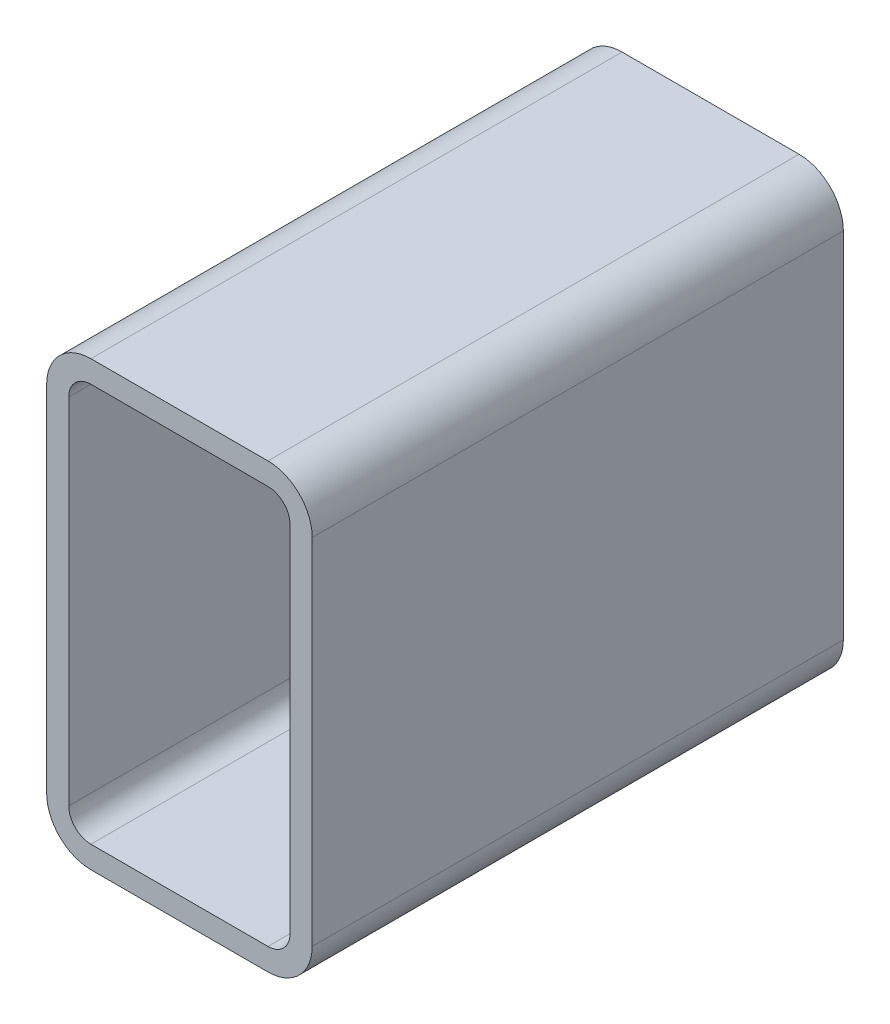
ISO-10303-21;
HEADER;
FILE_DESCRIPTION(('STEP AP214'),'2;1');
FILE_NAME('part.step','',(''),(''),'','','');
FILE_SCHEMA(('AUTOMOTIVE_DESIGN { 1 0 10303 214 1 1 1 1 }'));
ENDSEC;
DATA;
#1=APPLICATION_CONTEXT('core data for automotive mechanical design processes');
#2=APPLICATION_PROTOCOL_DEFINITION('international standard','automotive_design',2000,#1);
#3=PRODUCT_CONTEXT('',#1,'mechanical');
#4=PRODUCT('Part','Part','',(#3));
#5=PRODUCT_RELATED_PRODUCT_CATEGORY('part','',(#4));
#6=PRODUCT_DEFINITION_FORMATION('','',#4);
#7=PRODUCT_DEFINITION_CONTEXT('part definition',#1,'design');
#8=PRODUCT_DEFINITION('design','',#6,#7);
#9=PRODUCT_DEFINITION_SHAPE('','',#8);
#10=(LENGTH_UNIT() NAMED_UNIT(*) SI_UNIT(.MILLI.,.METRE.));
#11=(NAMED_UNIT(*) PLANE_ANGLE_UNIT() SI_UNIT($,.RADIAN.));
#12=(NAMED_UNIT(*) SI_UNIT($,.STERADIAN.) SOLID_ANGLE_UNIT());
#13=UNCERTAINTY_MEASURE_WITH_UNIT(LENGTH_MEASURE(1.E-05),#10,'distance_accuracy_value','');
#14=(GEOMETRIC_REPRESENTATION_CONTEXT(3) GLOBAL_UNCERTAINTY_ASSIGNED_CONTEXT((#13)) GLOBAL_UNIT_ASSIGNED_CONTEXT((#10,
#11,#12)) REPRESENTATION_CONTEXT('',''));
#15=CARTESIAN_POINT('',(0.,0.,0.));
#16=DIRECTION('',(0.,0.,1.));
#17=DIRECTION('',(1.,0.,0.));
#18=AXIS2_PLACEMENT_3D('',#15,#16,#17);
#19=CARTESIAN_POINT('',(25.4473013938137,230.520313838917,304.8));
#20=DIRECTION('',(0.,0.,1.));
#21=DIRECTION('',(1.,0.,0.));
#22=AXIS2_PLACEMENT_3D('',#19,#20,#21);
#23=PLANE('',#22);
#24=CARTESIAN_POINT('',(25.4473013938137,230.520313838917,304.8));
#25=DIRECTION('',(0.,0.,1.));
#26=DIRECTION('',(1.,0.,0.));
#27=AXIS2_PLACEMENT_3D('',#24,#25,#26);
#28=CIRCLE('',#27,25.4);
#29=CARTESIAN_POINT('',(25.4473013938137,255.920313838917,304.8));
#30=VERTEX_POINT('',#29);
#31=CARTESIAN_POINT('',(0.0473013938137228,230.520313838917,304.8));
#32=VERTEX_POINT('',#31);
#33=EDGE_CURVE('E211',#30,#32,#28,.T.);
#34=ORIENTED_EDGE('',*,*,#33,.T.);
#35=DIRECTION('',(0.,-1.,0.));
#36=VECTOR('',#35,1.);
#37=CARTESIAN_POINT('',(0.0473013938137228,27.3203138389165,304.8));
#38=LINE('',#37,#36);
#39=CARTESIAN_POINT('',(0.0473013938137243,27.3203138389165,304.8));
#40=VERTEX_POINT('',#39);
#41=EDGE_CURVE('E214',#32,#40,#38,.T.);
#42=ORIENTED_EDGE('',*,*,#41,.T.);
#43=CARTESIAN_POINT('',(25.4473013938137,27.3203138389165,304.8));
#44=DIRECTION('',(0.,0.,1.));
#45=DIRECTION('',(1.,0.,0.));
#46=AXIS2_PLACEMENT_3D('',#43,#44,#45);
#47=CIRCLE('',#46,25.4);
#48=CARTESIAN_POINT('',(25.4473013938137,1.92031383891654,304.8));
#49=VERTEX_POINT('',#48);
#50=EDGE_CURVE('E217',#40,#49,#47,.T.);
#51=ORIENTED_EDGE('',*,*,#50,.T.);
#52=DIRECTION('',(1.,0.,0.));
#53=VECTOR('',#52,1.);
#54=CARTESIAN_POINT('',(127.047301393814,1.92031383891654,304.8));
#55=LINE('',#54,#53);
#56=CARTESIAN_POINT('',(127.047301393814,1.92031383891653,304.8));
#57=VERTEX_POINT('',#56);
#58=EDGE_CURVE('E219',#49,#57,#55,.T.);
#59=ORIENTED_EDGE('',*,*,#58,.T.);
#60=CARTESIAN_POINT('',(127.047301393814,27.3203138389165,304.8));
#61=DIRECTION('',(0.,0.,1.));
#62=DIRECTION('',(1.,0.,0.));
#63=AXIS2_PLACEMENT_3D('',#60,#61,#62);
#64=CIRCLE('',#63,25.4);
#65=CARTESIAN_POINT('',(152.447301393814,27.3203138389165,304.8));
#66=VERTEX_POINT('',#65);
#67=EDGE_CURVE('E221',#57,#66,#64,.T.);
#68=ORIENTED_EDGE('',*,*,#67,.T.);
#69=DIRECTION('',(0.,1.,0.));
#70=VECTOR('',#69,1.);
#71=CARTESIAN_POINT('',(152.447301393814,230.520313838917,304.8));
#72=LINE('',#71,#70);
#73=CARTESIAN_POINT('',(152.447301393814,230.520313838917,304.8));
#74=VERTEX_POINT('',#73);
#75=EDGE_CURVE('E223',#66,#74,#72,.T.);
#76=ORIENTED_EDGE('',*,*,#75,.T.);
#77=CARTESIAN_POINT('',(127.047301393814,230.520313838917,304.8));
#78=DIRECTION('',(0.,0.,1.));
#79=DIRECTION('',(1.,0.,0.));
#80=AXIS2_PLACEMENT_3D('',#77,#78,#79);
#81=CIRCLE('',#80,25.4);
#82=CARTESIAN_POINT('',(127.047301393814,255.920313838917,304.8));
#83=VERTEX_POINT('',#82);
#84=EDGE_CURVE('E225',#74,#83,#81,.T.);
#85=ORIENTED_EDGE('',*,*,#84,.T.);
#86=DIRECTION('',(-1.,0.,0.));
#87=VECTOR('',#86,1.);
#88=CARTESIAN_POINT('',(25.4473013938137,255.920313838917,304.8));
#89=LINE('',#88,#87);
#90=EDGE_CURVE('E227',#83,#30,#89,.T.);
#91=ORIENTED_EDGE('',*,*,#90,.T.);
#92=EDGE_LOOP('',(#34,#42,#51,#59,#68,#76,#85,#91));
#93=FACE_BOUND('',#92,.T.);
#94=DIRECTION('',(0.,-1.,0.));
#95=VECTOR('',#94,1.);
#96=CARTESIAN_POINT('',(12.7473013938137,27.3203138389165,304.8));
#97=LINE('',#96,#95);
#98=CARTESIAN_POINT('',(12.7473013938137,230.520313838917,304.8));
#99=VERTEX_POINT('',#98);
#100=CARTESIAN_POINT('',(12.7473013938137,27.3203138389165,304.8));
#101=VERTEX_POINT('',#100);
#102=EDGE_CURVE('E154',#99,#101,#97,.T.);
#103=ORIENTED_EDGE('',*,*,#102,.F.);
#104=CARTESIAN_POINT('',(25.4473013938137,230.520313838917,304.8));
#105=DIRECTION('',(0.,0.,1.));
#106=DIRECTION('',(1.,0.,0.));
#107=AXIS2_PLACEMENT_3D('',#104,#105,#106);
#108=CIRCLE('',#107,12.7);
#109=CARTESIAN_POINT('',(25.4473013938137,243.220313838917,304.8));
#110=VERTEX_POINT('',#109);
#111=EDGE_CURVE('E146',#110,#99,#108,.T.);
#112=ORIENTED_EDGE('',*,*,#111,.F.);
#113=DIRECTION('',(-1.,0.,0.));
#114=VECTOR('',#113,1.);
#115=CARTESIAN_POINT('',(25.4473013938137,243.220313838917,304.8));
#116=LINE('',#115,#114);
#117=CARTESIAN_POINT('',(127.047301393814,243.220313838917,304.8));
#118=VERTEX_POINT('',#117);
#119=EDGE_CURVE('E179',#118,#110,#116,.T.);
#120=ORIENTED_EDGE('',*,*,#119,.F.);
#121=CARTESIAN_POINT('',(127.047301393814,230.520313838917,304.8));
#122=DIRECTION('',(0.,0.,1.));
#123=DIRECTION('',(1.,0.,0.));
#124=AXIS2_PLACEMENT_3D('',#121,#122,#123);
#125=CIRCLE('',#124,12.7);
#126=CARTESIAN_POINT('',(139.747301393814,230.520313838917,304.8));
#127=VERTEX_POINT('',#126);
#128=EDGE_CURVE('E177',#127,#118,#125,.T.);
#129=ORIENTED_EDGE('',*,*,#128,.F.);
#130=DIRECTION('',(0.,1.,0.));
#131=VECTOR('',#130,1.);
#132=CARTESIAN_POINT('',(139.747301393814,230.520313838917,304.8));
#133=LINE('',#132,#131);
#134=CARTESIAN_POINT('',(139.747301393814,27.3203138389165,304.8));
#135=VERTEX_POINT('',#134);
#136=EDGE_CURVE('E175',#135,#127,#133,.T.);
#137=ORIENTED_EDGE('',*,*,#136,.F.);
#138=CARTESIAN_POINT('',(127.047301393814,27.3203138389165,304.8));
#139=DIRECTION('',(0.,0.,1.));
#140=DIRECTION('',(1.,0.,0.));
#141=AXIS2_PLACEMENT_3D('',#138,#139,#140);
#142=CIRCLE('',#141,12.7);
#143=CARTESIAN_POINT('',(127.047301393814,14.6203138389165,304.8));
#144=VERTEX_POINT('',#143);
#145=EDGE_CURVE('E173',#144,#135,#142,.T.);
#146=ORIENTED_EDGE('',*,*,#145,.F.);
#147=DIRECTION('',(1.,0.,0.));
#148=VECTOR('',#147,1.);
#149=CARTESIAN_POINT('',(127.047301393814,14.6203138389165,304.8));
#150=LINE('',#149,#148);
#151=CARTESIAN_POINT('',(25.4473013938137,14.6203138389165,304.8));
#152=VERTEX_POINT('',#151);
#153=EDGE_CURVE('E169',#152,#144,#150,.T.);
#154=ORIENTED_EDGE('',*,*,#153,.F.);
#155=CARTESIAN_POINT('',(25.4473013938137,27.3203138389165,304.8));
#156=DIRECTION('',(0.,0.,1.));
#157=DIRECTION('',(1.,0.,0.));
#158=AXIS2_PLACEMENT_3D('',#155,#156,#157);
#159=CIRCLE('',#158,12.7);
#160=EDGE_CURVE('E167',#101,#152,#159,.T.);
#161=ORIENTED_EDGE('',*,*,#160,.F.);
#162=EDGE_LOOP('',(#103,#112,#120,#129,#137,#146,#154,#161));
#163=FACE_BOUND('',#162,.T.);
#164=ADVANCED_FACE('F33',(#93,#163),#23,.T.);
#165=CARTESIAN_POINT('',(25.4473013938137,230.520313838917,0.));
#166=DIRECTION('',(0.,0.,1.));
#167=DIRECTION('',(1.,0.,0.));
#168=AXIS2_PLACEMENT_3D('',#165,#166,#167);
#169=PLANE('',#168);
#170=CARTESIAN_POINT('',(25.4473013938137,230.520313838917,0.));
#171=DIRECTION('',(0.,0.,1.));
#172=DIRECTION('',(1.,0.,0.));
#173=AXIS2_PLACEMENT_3D('',#170,#171,#172);
#174=CIRCLE('',#173,25.4);
#175=CARTESIAN_POINT('',(25.4473013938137,255.920313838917,0.));
#176=VERTEX_POINT('',#175);
#177=CARTESIAN_POINT('',(0.0473013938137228,230.520313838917,0.));
#178=VERTEX_POINT('',#177);
#179=EDGE_CURVE('E162',#176,#178,#174,.T.);
#180=ORIENTED_EDGE('',*,*,#179,.F.);
#181=DIRECTION('',(-1.,0.,0.));
#182=VECTOR('',#181,1.);
#183=CARTESIAN_POINT('',(25.4473013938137,255.920313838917,0.));
#184=LINE('',#183,#182);
#185=CARTESIAN_POINT('',(127.047301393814,255.920313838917,0.));
#186=VERTEX_POINT('',#185);
#187=EDGE_CURVE('E215',#186,#176,#184,.T.);
#188=ORIENTED_EDGE('',*,*,#187,.F.);
#189=CARTESIAN_POINT('',(127.047301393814,230.520313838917,0.));
#190=DIRECTION('',(0.,0.,1.));
#191=DIRECTION('',(1.,0.,0.));
#192=AXIS2_PLACEMENT_3D('',#189,#190,#191);
#193=CIRCLE('',#192,25.4);
#194=CARTESIAN_POINT('',(152.447301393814,230.520313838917,0.));
#195=VERTEX_POINT('',#194);
#196=EDGE_CURVE('E242',#195,#186,#193,.T.);
#197=ORIENTED_EDGE('',*,*,#196,.F.);
#198=DIRECTION('',(0.,1.,0.));
#199=VECTOR('',#198,1.);
#200=CARTESIAN_POINT('',(152.447301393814,230.520313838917,0.));
#201=LINE('',#200,#199);
#202=CARTESIAN_POINT('',(152.447301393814,27.3203138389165,0.));
#203=VERTEX_POINT('',#202);
#204=EDGE_CURVE('E240',#203,#195,#201,.T.);
#205=ORIENTED_EDGE('',*,*,#204,.F.);
#206=CARTESIAN_POINT('',(127.047301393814,27.3203138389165,0.));
#207=DIRECTION('',(0.,0.,1.));
#208=DIRECTION('',(1.,0.,0.));
#209=AXIS2_PLACEMENT_3D('',#206,#207,#208);
#210=CIRCLE('',#209,25.4);
#211=CARTESIAN_POINT('',(127.047301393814,1.92031383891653,0.));
#212=VERTEX_POINT('',#211);
#213=EDGE_CURVE('E238',#212,#203,#210,.T.);
#214=ORIENTED_EDGE('',*,*,#213,.F.);
#215=DIRECTION('',(1.,0.,0.));
#216=VECTOR('',#215,1.);
#217=CARTESIAN_POINT('',(127.047301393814,1.92031383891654,0.));
#218=LINE('',#217,#216);
#219=CARTESIAN_POINT('',(25.4473013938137,1.92031383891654,0.));
#220=VERTEX_POINT('',#219);
#221=EDGE_CURVE('E236',#220,#212,#218,.T.);
#222=ORIENTED_EDGE('',*,*,#221,.F.);
#223=CARTESIAN_POINT('',(25.4473013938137,27.3203138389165,0.));
#224=DIRECTION('',(0.,0.,1.));
#225=DIRECTION('',(1.,0.,0.));
#226=AXIS2_PLACEMENT_3D('',#223,#224,#225);
#227=CIRCLE('',#226,25.4);
#228=CARTESIAN_POINT('',(0.0473013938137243,27.3203138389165,0.));
#229=VERTEX_POINT('',#228);
#230=EDGE_CURVE('E234',#229,#220,#227,.T.);
#231=ORIENTED_EDGE('',*,*,#230,.F.);
#232=DIRECTION('',(0.,-1.,0.));
#233=VECTOR('',#232,1.);
#234=CARTESIAN_POINT('',(0.0473013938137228,27.3203138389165,0.));
#235=LINE('',#234,#233);
#236=EDGE_CURVE('E232',#178,#229,#235,.T.);
#237=ORIENTED_EDGE('',*,*,#236,.F.);
#238=EDGE_LOOP('',(#180,#188,#197,#205,#214,#222,#231,#237));
#239=FACE_BOUND('',#238,.T.);
#240=CARTESIAN_POINT('',(25.4473013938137,230.520313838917,0.));
#241=DIRECTION('',(0.,0.,1.));
#242=DIRECTION('',(1.,0.,0.));
#243=AXIS2_PLACEMENT_3D('',#240,#241,#242);
#244=CIRCLE('',#243,12.7);
#245=CARTESIAN_POINT('',(25.4473013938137,243.220313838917,0.));
#246=VERTEX_POINT('',#245);
#247=CARTESIAN_POINT('',(12.7473013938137,230.520313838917,0.));
#248=VERTEX_POINT('',#247);
#249=EDGE_CURVE('E56',#246,#248,#244,.T.);
#250=ORIENTED_EDGE('',*,*,#249,.T.);
#251=DIRECTION('',(0.,-1.,0.));
#252=VECTOR('',#251,1.);
#253=CARTESIAN_POINT('',(12.7473013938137,27.3203138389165,0.));
#254=LINE('',#253,#252);
#255=CARTESIAN_POINT('',(12.7473013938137,27.3203138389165,0.));
#256=VERTEX_POINT('',#255);
#257=EDGE_CURVE('E161',#248,#256,#254,.T.);
#258=ORIENTED_EDGE('',*,*,#257,.T.);
#259=CARTESIAN_POINT('',(25.4473013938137,27.3203138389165,0.));
#260=DIRECTION('',(0.,0.,1.));
#261=DIRECTION('',(1.,0.,0.));
#262=AXIS2_PLACEMENT_3D('',#259,#260,#261);
#263=CIRCLE('',#262,12.7);
#264=CARTESIAN_POINT('',(25.4473013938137,14.6203138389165,0.));
#265=VERTEX_POINT('',#264);
#266=EDGE_CURVE('E183',#256,#265,#263,.T.);
#267=ORIENTED_EDGE('',*,*,#266,.T.);
#268=DIRECTION('',(1.,0.,0.));
#269=VECTOR('',#268,1.);
#270=CARTESIAN_POINT('',(127.047301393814,14.6203138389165,0.));
#271=LINE('',#270,#269);
#272=CARTESIAN_POINT('',(127.047301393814,14.6203138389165,0.));
#273=VERTEX_POINT('',#272);
#274=EDGE_CURVE('E186',#265,#273,#271,.T.);
#275=ORIENTED_EDGE('',*,*,#274,.T.);
#276=CARTESIAN_POINT('',(127.047301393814,27.3203138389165,0.));
#277=DIRECTION('',(0.,0.,1.));
#278=DIRECTION('',(1.,0.,0.));
#279=AXIS2_PLACEMENT_3D('',#276,#277,#278);
#280=CIRCLE('',#279,12.7);
#281=CARTESIAN_POINT('',(139.747301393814,27.3203138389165,0.));
#282=VERTEX_POINT('',#281);
#283=EDGE_CURVE('E189',#273,#282,#280,.T.);
#284=ORIENTED_EDGE('',*,*,#283,.T.);
#285=DIRECTION('',(0.,1.,0.));
#286=VECTOR('',#285,1.);
#287=CARTESIAN_POINT('',(139.747301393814,230.520313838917,0.));
#288=LINE('',#287,#286);
#289=CARTESIAN_POINT('',(139.747301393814,230.520313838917,0.));
#290=VERTEX_POINT('',#289);
#291=EDGE_CURVE('E192',#282,#290,#288,.T.);
#292=ORIENTED_EDGE('',*,*,#291,.T.);
#293=CARTESIAN_POINT('',(127.047301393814,230.520313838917,0.));
#294=DIRECTION('',(0.,0.,1.));
#295=DIRECTION('',(1.,0.,0.));
#296=AXIS2_PLACEMENT_3D('',#293,#294,#295);
#297=CIRCLE('',#296,12.7);
#298=CARTESIAN_POINT('',(127.047301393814,243.220313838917,0.));
#299=VERTEX_POINT('',#298);
#300=EDGE_CURVE('E195',#290,#299,#297,.T.);
#301=ORIENTED_EDGE('',*,*,#300,.T.);
#302=DIRECTION('',(-1.,0.,0.));
#303=VECTOR('',#302,1.);
#304=CARTESIAN_POINT('',(25.4473013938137,243.220313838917,0.));
#305=LINE('',#304,#303);
#306=EDGE_CURVE('E155',#299,#246,#305,.T.);
#307=ORIENTED_EDGE('',*,*,#306,.T.);
#308=EDGE_LOOP('',(#250,#258,#267,#275,#284,#292,#301,#307));
#309=FACE_BOUND('',#308,.T.);
#310=ADVANCED_FACE('F272',(#239,#309),#169,.F.);
#311=CARTESIAN_POINT('',(25.4473013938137,230.520313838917,304.8));
#312=DIRECTION('',(0.,0.,-1.));
#313=DIRECTION('',(-1.,0.,0.));
#314=AXIS2_PLACEMENT_3D('',#311,#312,#313);
#315=CYLINDRICAL_SURFACE('',#314,25.4);
#316=ORIENTED_EDGE('',*,*,#179,.T.);
#317=DIRECTION('',(0.,0.,-1.));
#318=VECTOR('',#317,1.);
#319=CARTESIAN_POINT('',(0.0473013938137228,230.520313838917,304.8));
#320=LINE('',#319,#318);
#321=EDGE_CURVE('E11',#32,#178,#320,.T.);
#322=ORIENTED_EDGE('',*,*,#321,.F.);
#323=ORIENTED_EDGE('',*,*,#33,.F.);
#324=DIRECTION('',(0.,0.,-1.));
#325=VECTOR('',#324,1.);
#326=CARTESIAN_POINT('',(25.4473013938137,255.920313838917,304.8));
#327=LINE('',#326,#325);
#328=EDGE_CURVE('E229',#30,#176,#327,.T.);
#329=ORIENTED_EDGE('',*,*,#328,.T.);
#330=EDGE_LOOP('',(#316,#322,#323,#329));
#331=FACE_BOUND('',#330,.T.);
#332=ADVANCED_FACE('F35',(#331),#315,.T.);
#333=CARTESIAN_POINT('',(0.0473013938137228,27.3203138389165,304.8));
#334=DIRECTION('',(1.,0.,0.));
#335=DIRECTION('',(0.,0.,-1.));
#336=AXIS2_PLACEMENT_3D('',#333,#334,#335);
#337=PLANE('',#336);
#338=ORIENTED_EDGE('',*,*,#236,.T.);
#339=DIRECTION('',(0.,0.,-1.));
#340=VECTOR('',#339,1.);
#341=CARTESIAN_POINT('',(0.0473013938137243,27.3203138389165,304.8));
#342=LINE('',#341,#340);
#343=EDGE_CURVE('E41',#40,#229,#342,.T.);
#344=ORIENTED_EDGE('',*,*,#343,.F.);
#345=ORIENTED_EDGE('',*,*,#41,.F.);
#346=ORIENTED_EDGE('',*,*,#321,.T.);
#347=EDGE_LOOP('',(#338,#344,#345,#346));
#348=FACE_BOUND('',#347,.T.);
#349=ADVANCED_FACE('F289',(#348),#337,.F.);
#350=CARTESIAN_POINT('',(25.4473013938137,27.3203138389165,304.8));
#351=DIRECTION('',(0.,0.,-1.));
#352=DIRECTION('',(-1.,0.,0.));
#353=AXIS2_PLACEMENT_3D('',#350,#351,#352);
#354=CYLINDRICAL_SURFACE('',#353,25.4);
#355=ORIENTED_EDGE('',*,*,#230,.T.);
#356=DIRECTION('',(0.,0.,-1.));
#357=VECTOR('',#356,1.);
#358=CARTESIAN_POINT('',(25.4473013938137,1.92031383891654,304.8));
#359=LINE('',#358,#357);
#360=EDGE_CURVE('E259',#49,#220,#359,.T.);
#361=ORIENTED_EDGE('',*,*,#360,.F.);
#362=ORIENTED_EDGE('',*,*,#50,.F.);
#363=ORIENTED_EDGE('',*,*,#343,.T.);
#364=EDGE_LOOP('',(#355,#361,#362,#363));
#365=FACE_BOUND('',#364,.T.);
#366=ADVANCED_FACE('F266',(#365),#354,.T.);
#367=CARTESIAN_POINT('',(127.047301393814,1.92031383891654,304.8));
#368=DIRECTION('',(0.,1.,0.));
#369=DIRECTION('',(0.,0.,1.));
#370=AXIS2_PLACEMENT_3D('',#367,#368,#369);
#371=PLANE('',#370);
#372=ORIENTED_EDGE('',*,*,#221,.T.);
#373=DIRECTION('',(0.,0.,-1.));
#374=VECTOR('',#373,1.);
#375=CARTESIAN_POINT('',(127.047301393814,1.92031383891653,304.8));
#376=LINE('',#375,#374);
#377=EDGE_CURVE('E256',#57,#212,#376,.T.);
#378=ORIENTED_EDGE('',*,*,#377,.F.);
#379=ORIENTED_EDGE('',*,*,#58,.F.);
#380=ORIENTED_EDGE('',*,*,#360,.T.);
#381=EDGE_LOOP('',(#372,#378,#379,#380));
#382=FACE_BOUND('',#381,.T.);
#383=ADVANCED_FACE('F278',(#382),#371,.F.);
#384=CARTESIAN_POINT('',(127.047301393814,27.3203138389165,304.8));
#385=DIRECTION('',(0.,0.,-1.));
#386=DIRECTION('',(-1.,0.,0.));
#387=AXIS2_PLACEMENT_3D('',#384,#385,#386);
#388=CYLINDRICAL_SURFACE('',#387,25.4);
#389=ORIENTED_EDGE('',*,*,#213,.T.);
#390=DIRECTION('',(0.,0.,-1.));
#391=VECTOR('',#390,1.);
#392=CARTESIAN_POINT('',(152.447301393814,27.3203138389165,304.8));
#393=LINE('',#392,#391);
#394=EDGE_CURVE('E253',#66,#203,#393,.T.);
#395=ORIENTED_EDGE('',*,*,#394,.F.);
#396=ORIENTED_EDGE('',*,*,#67,.F.);
#397=ORIENTED_EDGE('',*,*,#377,.T.);
#398=EDGE_LOOP('',(#389,#395,#396,#397));
#399=FACE_BOUND('',#398,.T.);
#400=ADVANCED_FACE('F282',(#399),#388,.T.);
#401=CARTESIAN_POINT('',(152.447301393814,230.520313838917,304.8));
#402=DIRECTION('',(-1.,0.,0.));
#403=DIRECTION('',(0.,0.,1.));
#404=AXIS2_PLACEMENT_3D('',#401,#402,#403);
#405=PLANE('',#404);
#406=ORIENTED_EDGE('',*,*,#204,.T.);
#407=DIRECTION('',(0.,0.,-1.));
#408=VECTOR('',#407,1.);
#409=CARTESIAN_POINT('',(152.447301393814,230.520313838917,304.8));
#410=LINE('',#409,#408);
#411=EDGE_CURVE('E250',#74,#195,#410,.T.);
#412=ORIENTED_EDGE('',*,*,#411,.F.);
#413=ORIENTED_EDGE('',*,*,#75,.F.);
#414=ORIENTED_EDGE('',*,*,#394,.T.);
#415=EDGE_LOOP('',(#406,#412,#413,#414));
#416=FACE_BOUND('',#415,.T.);
#417=ADVANCED_FACE('F302',(#416),#405,.F.);
#418=CARTESIAN_POINT('',(127.047301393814,230.520313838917,304.8));
#419=DIRECTION('',(0.,0.,-1.));
#420=DIRECTION('',(-1.,0.,0.));
#421=AXIS2_PLACEMENT_3D('',#418,#419,#420);
#422=CYLINDRICAL_SURFACE('',#421,25.4);
#423=ORIENTED_EDGE('',*,*,#196,.T.);
#424=DIRECTION('',(0.,0.,-1.));
#425=VECTOR('',#424,1.);
#426=CARTESIAN_POINT('',(127.047301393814,255.920313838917,304.8));
#427=LINE('',#426,#425);
#428=EDGE_CURVE('E247',#83,#186,#427,.T.);
#429=ORIENTED_EDGE('',*,*,#428,.F.);
#430=ORIENTED_EDGE('',*,*,#84,.F.);
#431=ORIENTED_EDGE('',*,*,#411,.T.);
#432=EDGE_LOOP('',(#423,#429,#430,#431));
#433=FACE_BOUND('',#432,.T.);
#434=ADVANCED_FACE('F300',(#433),#422,.T.);
#435=CARTESIAN_POINT('',(25.4473013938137,255.920313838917,304.8));
#436=DIRECTION('',(0.,-1.,0.));
#437=DIRECTION('',(0.,0.,-1.));
#438=AXIS2_PLACEMENT_3D('',#435,#436,#437);
#439=PLANE('',#438);
#440=ORIENTED_EDGE('',*,*,#187,.T.);
#441=ORIENTED_EDGE('',*,*,#328,.F.);
#442=ORIENTED_EDGE('',*,*,#90,.F.);
#443=ORIENTED_EDGE('',*,*,#428,.T.);
#444=EDGE_LOOP('',(#440,#441,#442,#443));
#445=FACE_BOUND('',#444,.T.);
#446=ADVANCED_FACE('F295',(#445),#439,.F.);
#447=CARTESIAN_POINT('',(25.4473013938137,230.520313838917,304.8));
#448=DIRECTION('',(0.,0.,-1.));
#449=DIRECTION('',(-1.,0.,0.));
#450=AXIS2_PLACEMENT_3D('',#447,#448,#449);
#451=CYLINDRICAL_SURFACE('',#450,12.7);
#452=ORIENTED_EDGE('',*,*,#249,.F.);
#453=DIRECTION('',(0.,0.,-1.));
#454=VECTOR('',#453,1.);
#455=CARTESIAN_POINT('',(25.4473013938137,243.220313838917,304.8));
#456=LINE('',#455,#454);
#457=EDGE_CURVE('E150',#110,#246,#456,.T.);
#458=ORIENTED_EDGE('',*,*,#457,.F.);
#459=ORIENTED_EDGE('',*,*,#111,.T.);
#460=DIRECTION('',(0.,0.,-1.));
#461=VECTOR('',#460,1.);
#462=CARTESIAN_POINT('',(12.7473013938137,230.520313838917,304.8));
#463=LINE('',#462,#461);
#464=EDGE_CURVE('E149',#99,#248,#463,.T.);
#465=ORIENTED_EDGE('',*,*,#464,.T.);
#466=EDGE_LOOP('',(#452,#458,#459,#465));
#467=FACE_BOUND('',#466,.T.);
#468=ADVANCED_FACE('F148',(#467),#451,.F.);
#469=CARTESIAN_POINT('',(12.7473013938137,27.3203138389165,304.8));
#470=DIRECTION('',(1.,0.,0.));
#471=DIRECTION('',(0.,0.,-1.));
#472=AXIS2_PLACEMENT_3D('',#469,#470,#471);
#473=PLANE('',#472);
#474=ORIENTED_EDGE('',*,*,#257,.F.);
#475=ORIENTED_EDGE('',*,*,#464,.F.);
#476=ORIENTED_EDGE('',*,*,#102,.T.);
#477=DIRECTION('',(0.,0.,-1.));
#478=VECTOR('',#477,1.);
#479=CARTESIAN_POINT('',(12.7473013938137,27.3203138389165,304.8));
#480=LINE('',#479,#478);
#481=EDGE_CURVE('E163',#101,#256,#480,.T.);
#482=ORIENTED_EDGE('',*,*,#481,.T.);
#483=EDGE_LOOP('',(#474,#475,#476,#482));
#484=FACE_BOUND('',#483,.T.);
#485=ADVANCED_FACE('F158',(#484),#473,.T.);
#486=CARTESIAN_POINT('',(25.4473013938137,27.3203138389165,304.8));
#487=DIRECTION('',(0.,0.,-1.));
#488=DIRECTION('',(-1.,0.,0.));
#489=AXIS2_PLACEMENT_3D('',#486,#487,#488);
#490=CYLINDRICAL_SURFACE('',#489,12.7);
#491=ORIENTED_EDGE('',*,*,#266,.F.);
#492=ORIENTED_EDGE('',*,*,#481,.F.);
#493=ORIENTED_EDGE('',*,*,#160,.T.);
#494=DIRECTION('',(0.,0.,-1.));
#495=VECTOR('',#494,1.);
#496=CARTESIAN_POINT('',(25.4473013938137,14.6203138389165,304.8));
#497=LINE('',#496,#495);
#498=EDGE_CURVE('E208',#152,#265,#497,.T.);
#499=ORIENTED_EDGE('',*,*,#498,.T.);
#500=EDGE_LOOP('',(#491,#492,#493,#499));
#501=FACE_BOUND('',#500,.T.);
#502=ADVANCED_FACE('F327',(#501),#490,.F.);
#503=CARTESIAN_POINT('',(127.047301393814,14.6203138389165,304.8));
#504=DIRECTION('',(0.,1.,0.));
#505=DIRECTION('',(0.,0.,1.));
#506=AXIS2_PLACEMENT_3D('',#503,#504,#505);
#507=PLANE('',#506);
#508=ORIENTED_EDGE('',*,*,#274,.F.);
#509=ORIENTED_EDGE('',*,*,#498,.F.);
#510=ORIENTED_EDGE('',*,*,#153,.T.);
#511=DIRECTION('',(0.,0.,-1.));
#512=VECTOR('',#511,1.);
#513=CARTESIAN_POINT('',(127.047301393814,14.6203138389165,304.8));
#514=LINE('',#513,#512);
#515=EDGE_CURVE('E206',#144,#273,#514,.T.);
#516=ORIENTED_EDGE('',*,*,#515,.T.);
#517=EDGE_LOOP('',(#508,#509,#510,#516));
#518=FACE_BOUND('',#517,.T.);
#519=ADVANCED_FACE('F331',(#518),#507,.T.);
#520=CARTESIAN_POINT('',(127.047301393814,27.3203138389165,304.8));
#521=DIRECTION('',(0.,0.,-1.));
#522=DIRECTION('',(-1.,0.,0.));
#523=AXIS2_PLACEMENT_3D('',#520,#521,#522);
#524=CYLINDRICAL_SURFACE('',#523,12.7);
#525=ORIENTED_EDGE('',*,*,#283,.F.);
#526=ORIENTED_EDGE('',*,*,#515,.F.);
#527=ORIENTED_EDGE('',*,*,#145,.T.);
#528=DIRECTION('',(0.,0.,-1.));
#529=VECTOR('',#528,1.);
#530=CARTESIAN_POINT('',(139.747301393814,27.3203138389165,304.8));
#531=LINE('',#530,#529);
#532=EDGE_CURVE('E204',#135,#282,#531,.T.);
#533=ORIENTED_EDGE('',*,*,#532,.T.);
#534=EDGE_LOOP('',(#525,#526,#527,#533));
#535=FACE_BOUND('',#534,.T.);
#536=ADVANCED_FACE('F337',(#535),#524,.F.);
#537=CARTESIAN_POINT('',(139.747301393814,230.520313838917,304.8));
#538=DIRECTION('',(-1.,0.,0.));
#539=DIRECTION('',(0.,0.,1.));
#540=AXIS2_PLACEMENT_3D('',#537,#538,#539);
#541=PLANE('',#540);
#542=ORIENTED_EDGE('',*,*,#291,.F.);
#543=ORIENTED_EDGE('',*,*,#532,.F.);
#544=ORIENTED_EDGE('',*,*,#136,.T.);
#545=DIRECTION('',(0.,0.,-1.));
#546=VECTOR('',#545,1.);
#547=CARTESIAN_POINT('',(139.747301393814,230.520313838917,304.8));
#548=LINE('',#547,#546);
#549=EDGE_CURVE('E202',#127,#290,#548,.T.);
#550=ORIENTED_EDGE('',*,*,#549,.T.);
#551=EDGE_LOOP('',(#542,#543,#544,#550));
#552=FACE_BOUND('',#551,.T.);
#553=ADVANCED_FACE('F341',(#552),#541,.T.);
#554=CARTESIAN_POINT('',(127.047301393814,230.520313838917,304.8));
#555=DIRECTION('',(0.,0.,-1.));
#556=DIRECTION('',(-1.,0.,0.));
#557=AXIS2_PLACEMENT_3D('',#554,#555,#556);
#558=CYLINDRICAL_SURFACE('',#557,12.7);
#559=ORIENTED_EDGE('',*,*,#300,.F.);
#560=ORIENTED_EDGE('',*,*,#549,.F.);
#561=ORIENTED_EDGE('',*,*,#128,.T.);
#562=DIRECTION('',(0.,0.,-1.));
#563=VECTOR('',#562,1.);
#564=CARTESIAN_POINT('',(127.047301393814,243.220313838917,304.8));
#565=LINE('',#564,#563);
#566=EDGE_CURVE('E48',#118,#299,#565,.T.);
#567=ORIENTED_EDGE('',*,*,#566,.T.);
#568=EDGE_LOOP('',(#559,#560,#561,#567));
#569=FACE_BOUND('',#568,.T.);
#570=ADVANCED_FACE('F345',(#569),#558,.F.);
#571=CARTESIAN_POINT('',(25.4473013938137,243.220313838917,304.8));
#572=DIRECTION('',(0.,-1.,0.));
#573=DIRECTION('',(0.,0.,-1.));
#574=AXIS2_PLACEMENT_3D('',#571,#572,#573);
#575=PLANE('',#574);
#576=ORIENTED_EDGE('',*,*,#306,.F.);
#577=ORIENTED_EDGE('',*,*,#566,.F.);
#578=ORIENTED_EDGE('',*,*,#119,.T.);
#579=ORIENTED_EDGE('',*,*,#457,.T.);
#580=EDGE_LOOP('',(#576,#577,#578,#579));
#581=FACE_BOUND('',#580,.T.);
#582=ADVANCED_FACE('F349',(#581),#575,.T.);
#583=CLOSED_SHELL('',(#164,#310,#332,#349,#366,#383,#400,#417,#434,#446,#468,#485,#502,#519,
#536,#553,#570,#582));
#584=MANIFOLD_SOLID_BREP('B2',#583);
#585=ADVANCED_BREP_SHAPE_REPRESENTATION('',(#18,#584),#14);
#586=SHAPE_DEFINITION_REPRESENTATION(#9,#585);
ENDSEC;
END-ISO-10303-21;
